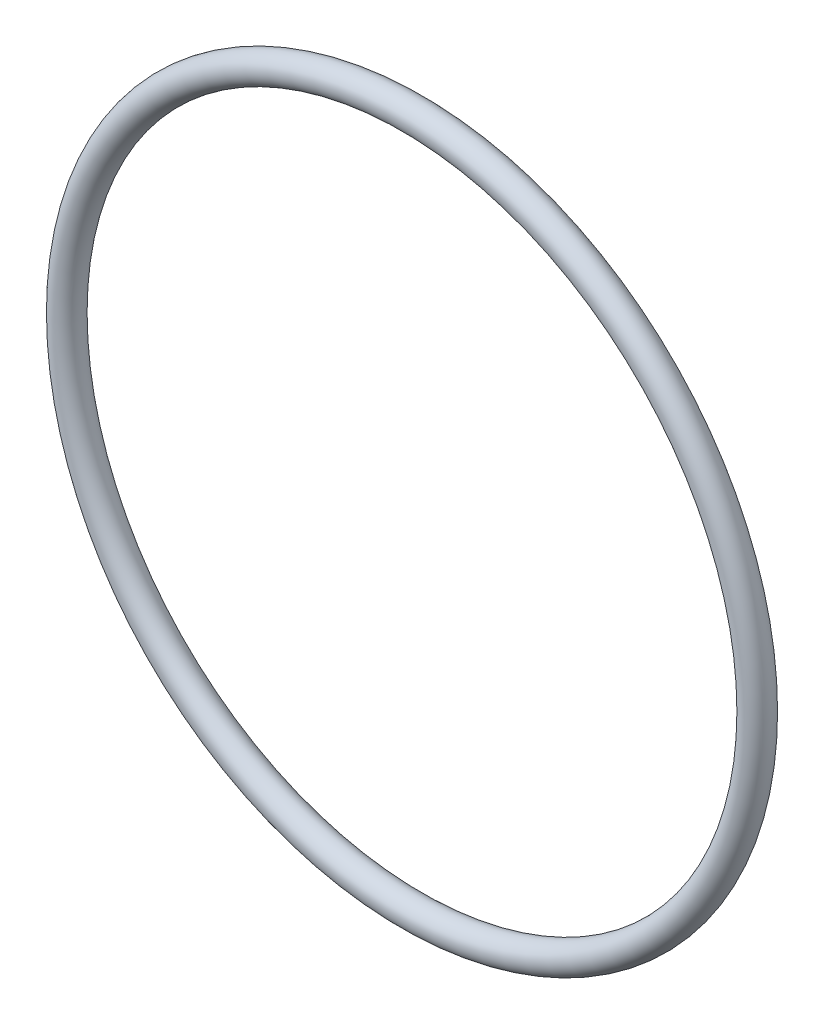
from build123d import *

# Parameters (mm, degrees)
ESQUISSE2_R = 0.5


with BuildPart() as part:
    # Esquisse2 → R_volution1 (revolve)
    with BuildSketch(Plane(origin=(0, 0, 0), x_dir=(0, 0, -1), z_dir=(1, 0, 0)), mode=Mode.PRIVATE) as r_volution1_sk:
        with Locations((-54.25, 12)):
            Circle(ESQUISSE2_R)
    revolve(r_volution1_sk.sketch.rotate(Axis((0, 0, 73.813694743), (0, 0, -1)), 90), axis=Axis((0, 0, 73.813694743), (0, 0, -1)))


solid = part.part
